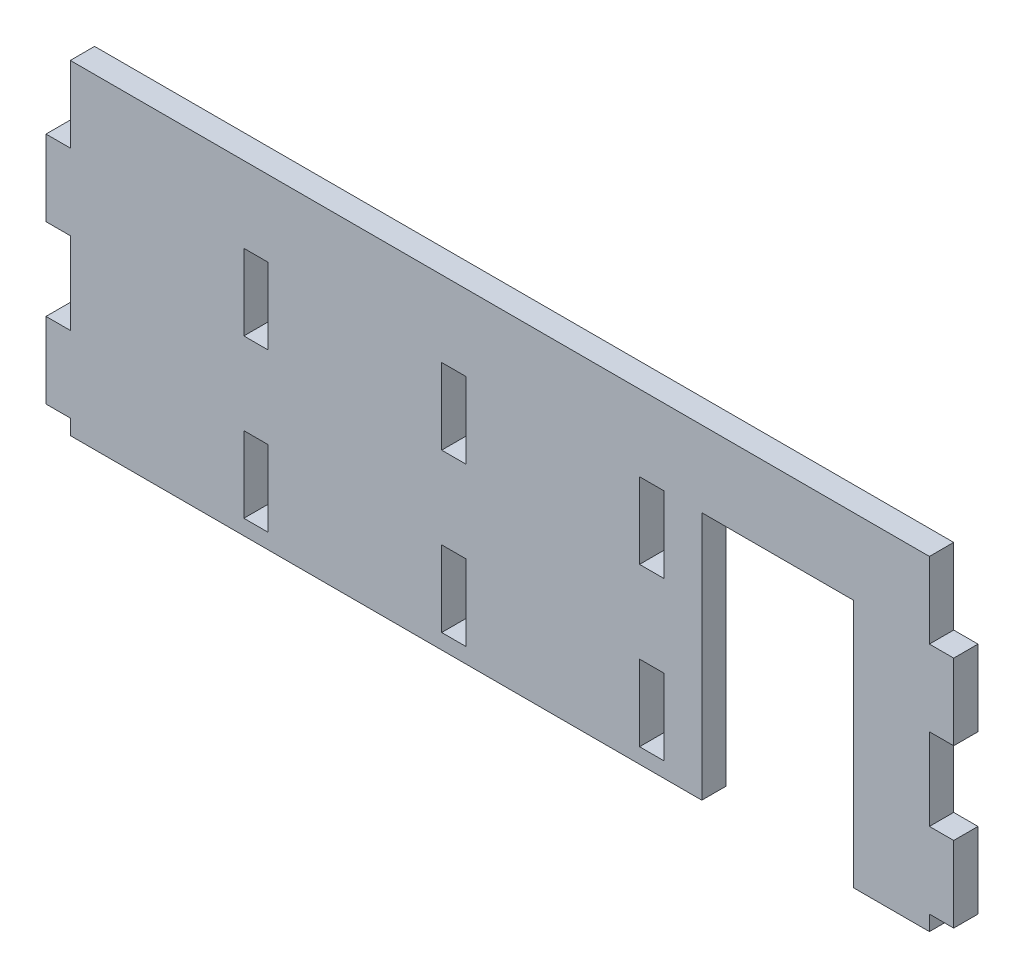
ISO-10303-21;
HEADER;
FILE_DESCRIPTION(('STEP AP214'),'2;1');
FILE_NAME('part.step','',(''),(''),'','','');
FILE_SCHEMA(('AUTOMOTIVE_DESIGN { 1 0 10303 214 1 1 1 1 }'));
ENDSEC;
DATA;
#1=APPLICATION_CONTEXT('core data for automotive mechanical design processes');
#2=APPLICATION_PROTOCOL_DEFINITION('international standard','automotive_design',2000,#1);
#3=PRODUCT_CONTEXT('',#1,'mechanical');
#4=PRODUCT('Part','Part','',(#3));
#5=PRODUCT_RELATED_PRODUCT_CATEGORY('part','',(#4));
#6=PRODUCT_DEFINITION_FORMATION('','',#4);
#7=PRODUCT_DEFINITION_CONTEXT('part definition',#1,'design');
#8=PRODUCT_DEFINITION('design','',#6,#7);
#9=PRODUCT_DEFINITION_SHAPE('','',#8);
#10=(LENGTH_UNIT() NAMED_UNIT(*) SI_UNIT(.MILLI.,.METRE.));
#11=(NAMED_UNIT(*) PLANE_ANGLE_UNIT() SI_UNIT($,.RADIAN.));
#12=(NAMED_UNIT(*) SI_UNIT($,.STERADIAN.) SOLID_ANGLE_UNIT());
#13=UNCERTAINTY_MEASURE_WITH_UNIT(LENGTH_MEASURE(1.E-05),#10,'distance_accuracy_value','');
#14=(GEOMETRIC_REPRESENTATION_CONTEXT(3) GLOBAL_UNCERTAINTY_ASSIGNED_CONTEXT((#13)) GLOBAL_UNIT_ASSIGNED_CONTEXT((#10,
#11,#12)) REPRESENTATION_CONTEXT('',''));
#15=CARTESIAN_POINT('',(0.,0.,0.));
#16=DIRECTION('',(0.,0.,1.));
#17=DIRECTION('',(1.,0.,0.));
#18=AXIS2_PLACEMENT_3D('',#15,#16,#17);
#19=CARTESIAN_POINT('',(415.9,0.,16.));
#20=DIRECTION('',(1.,0.,0.));
#21=DIRECTION('',(0.,0.,-1.));
#22=AXIS2_PLACEMENT_3D('',#19,#20,#21);
#23=PLANE('',#22);
#24=DIRECTION('',(0.,-1.,0.));
#25=VECTOR('',#24,1.);
#26=CARTESIAN_POINT('',(415.9,0.,0.));
#27=LINE('',#26,#25);
#28=CARTESIAN_POINT('',(415.9,204.,0.));
#29=VERTEX_POINT('',#28);
#30=CARTESIAN_POINT('',(415.9,40.,0.));
#31=VERTEX_POINT('',#30);
#32=EDGE_CURVE('E405',#29,#31,#27,.T.);
#33=ORIENTED_EDGE('',*,*,#32,.F.);
#34=DIRECTION('',(0.,0.,-1.));
#35=VECTOR('',#34,1.);
#36=CARTESIAN_POINT('',(415.9,204.,16.));
#37=LINE('',#36,#35);
#38=CARTESIAN_POINT('',(415.9,204.,16.));
#39=VERTEX_POINT('',#38);
#40=EDGE_CURVE('E449',#39,#29,#37,.T.);
#41=ORIENTED_EDGE('',*,*,#40,.F.);
#42=DIRECTION('',(0.,-1.,0.));
#43=VECTOR('',#42,1.);
#44=CARTESIAN_POINT('',(415.9,0.,16.));
#45=LINE('',#44,#43);
#46=CARTESIAN_POINT('',(415.9,40.,16.));
#47=VERTEX_POINT('',#46);
#48=EDGE_CURVE('E525',#39,#47,#45,.T.);
#49=ORIENTED_EDGE('',*,*,#48,.T.);
#50=DIRECTION('',(0.,0.,-1.));
#51=VECTOR('',#50,1.);
#52=CARTESIAN_POINT('',(415.9,40.,16.));
#53=LINE('',#52,#51);
#54=EDGE_CURVE('E444',#47,#31,#53,.T.);
#55=ORIENTED_EDGE('',*,*,#54,.T.);
#56=EDGE_LOOP('',(#33,#41,#49,#55));
#57=FACE_BOUND('',#56,.T.);
#58=ADVANCED_FACE('F179',(#57),#23,.T.);
#59=CARTESIAN_POINT('',(515.9,0.,16.));
#60=DIRECTION('',(1.,0.,0.));
#61=DIRECTION('',(0.,0.,-1.));
#62=AXIS2_PLACEMENT_3D('',#59,#60,#61);
#63=PLANE('',#62);
#64=DIRECTION('',(0.,-1.,0.));
#65=VECTOR('',#64,1.);
#66=CARTESIAN_POINT('',(515.9,0.,0.));
#67=LINE('',#66,#65);
#68=CARTESIAN_POINT('',(515.9,204.,0.));
#69=VERTEX_POINT('',#68);
#70=CARTESIAN_POINT('',(515.9,40.,0.));
#71=VERTEX_POINT('',#70);
#72=EDGE_CURVE('E397',#69,#71,#67,.T.);
#73=ORIENTED_EDGE('',*,*,#72,.T.);
#74=DIRECTION('',(0.,0.,-1.));
#75=VECTOR('',#74,1.);
#76=CARTESIAN_POINT('',(515.9,40.,16.));
#77=LINE('',#76,#75);
#78=CARTESIAN_POINT('',(515.9,40.,16.));
#79=VERTEX_POINT('',#78);
#80=EDGE_CURVE('E455',#79,#71,#77,.T.);
#81=ORIENTED_EDGE('',*,*,#80,.F.);
#82=DIRECTION('',(0.,-1.,0.));
#83=VECTOR('',#82,1.);
#84=CARTESIAN_POINT('',(515.9,0.,16.));
#85=LINE('',#84,#83);
#86=CARTESIAN_POINT('',(515.9,204.,16.));
#87=VERTEX_POINT('',#86);
#88=EDGE_CURVE('E686',#87,#79,#85,.T.);
#89=ORIENTED_EDGE('',*,*,#88,.F.);
#90=DIRECTION('',(0.,0.,-1.));
#91=VECTOR('',#90,1.);
#92=CARTESIAN_POINT('',(515.9,204.,16.));
#93=LINE('',#92,#91);
#94=EDGE_CURVE('E337',#87,#69,#93,.T.);
#95=ORIENTED_EDGE('',*,*,#94,.T.);
#96=EDGE_LOOP('',(#73,#81,#89,#95));
#97=FACE_BOUND('',#96,.T.);
#98=ADVANCED_FACE('F961',(#97),#63,.F.);
#99=CARTESIAN_POINT('',(0.,204.,16.));
#100=DIRECTION('',(0.,1.,0.));
#101=DIRECTION('',(0.,0.,1.));
#102=AXIS2_PLACEMENT_3D('',#99,#100,#101);
#103=PLANE('',#102);
#104=DIRECTION('',(1.,0.,0.));
#105=VECTOR('',#104,1.);
#106=CARTESIAN_POINT('',(0.,204.,0.));
#107=LINE('',#106,#105);
#108=EDGE_CURVE('E402',#29,#69,#107,.T.);
#109=ORIENTED_EDGE('',*,*,#108,.T.);
#110=ORIENTED_EDGE('',*,*,#94,.F.);
#111=DIRECTION('',(1.,0.,0.));
#112=VECTOR('',#111,1.);
#113=CARTESIAN_POINT('',(0.,204.,16.));
#114=LINE('',#113,#112);
#115=EDGE_CURVE('E691',#39,#87,#114,.T.);
#116=ORIENTED_EDGE('',*,*,#115,.F.);
#117=ORIENTED_EDGE('',*,*,#40,.T.);
#118=EDGE_LOOP('',(#109,#110,#116,#117));
#119=FACE_BOUND('',#118,.T.);
#120=ADVANCED_FACE('F669',(#119),#103,.F.);
#121=CARTESIAN_POINT('',(374.9,0.,16.));
#122=DIRECTION('',(1.,0.,0.));
#123=DIRECTION('',(0.,0.,-1.));
#124=AXIS2_PLACEMENT_3D('',#121,#122,#123);
#125=PLANE('',#124);
#126=DIRECTION('',(0.,-1.,0.));
#127=VECTOR('',#126,1.);
#128=CARTESIAN_POINT('',(374.9,0.,0.));
#129=LINE('',#128,#127);
#130=CARTESIAN_POINT('',(374.9,204.,0.));
#131=VERTEX_POINT('',#130);
#132=CARTESIAN_POINT('',(374.9,154.,0.));
#133=VERTEX_POINT('',#132);
#134=EDGE_CURVE('E661',#131,#133,#129,.T.);
#135=ORIENTED_EDGE('',*,*,#134,.F.);
#136=DIRECTION('',(0.,0.,-1.));
#137=VECTOR('',#136,1.);
#138=CARTESIAN_POINT('',(374.9,204.,16.));
#139=LINE('',#138,#137);
#140=CARTESIAN_POINT('',(374.9,204.,16.));
#141=VERTEX_POINT('',#140);
#142=EDGE_CURVE('E460',#141,#131,#139,.T.);
#143=ORIENTED_EDGE('',*,*,#142,.F.);
#144=DIRECTION('',(0.,-1.,0.));
#145=VECTOR('',#144,1.);
#146=CARTESIAN_POINT('',(374.9,0.,16.));
#147=LINE('',#146,#145);
#148=CARTESIAN_POINT('',(374.9,154.,16.));
#149=VERTEX_POINT('',#148);
#150=EDGE_CURVE('E694',#141,#149,#147,.T.);
#151=ORIENTED_EDGE('',*,*,#150,.T.);
#152=DIRECTION('',(0.,0.,-1.));
#153=VECTOR('',#152,1.);
#154=CARTESIAN_POINT('',(374.9,154.,16.));
#155=LINE('',#154,#153);
#156=EDGE_CURVE('E463',#149,#133,#155,.T.);
#157=ORIENTED_EDGE('',*,*,#156,.T.);
#158=EDGE_LOOP('',(#135,#143,#151,#157));
#159=FACE_BOUND('',#158,.T.);
#160=ADVANCED_FACE('F1003',(#159),#125,.T.);
#161=CARTESIAN_POINT('',(2.22044604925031E-13,154.000000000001,16.));
#162=DIRECTION('',(0.,1.,0.));
#163=DIRECTION('',(-1.,0.,0.));
#164=AXIS2_PLACEMENT_3D('',#161,#162,#163);
#165=PLANE('',#164);
#166=DIRECTION('',(1.,0.,0.));
#167=VECTOR('',#166,1.);
#168=CARTESIAN_POINT('',(2.22044604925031E-13,154.000000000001,0.));
#169=LINE('',#168,#167);
#170=CARTESIAN_POINT('',(390.9,154.,0.));
#171=VERTEX_POINT('',#170);
#172=EDGE_CURVE('E658',#133,#171,#169,.T.);
#173=ORIENTED_EDGE('',*,*,#172,.F.);
#174=ORIENTED_EDGE('',*,*,#156,.F.);
#175=DIRECTION('',(1.,0.,0.));
#176=VECTOR('',#175,1.);
#177=CARTESIAN_POINT('',(2.22044604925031E-13,154.000000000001,16.));
#178=LINE('',#177,#176);
#179=CARTESIAN_POINT('',(390.9,154.,16.));
#180=VERTEX_POINT('',#179);
#181=EDGE_CURVE('E699',#149,#180,#178,.T.);
#182=ORIENTED_EDGE('',*,*,#181,.T.);
#183=DIRECTION('',(0.,0.,-1.));
#184=VECTOR('',#183,1.);
#185=CARTESIAN_POINT('',(390.9,154.,16.));
#186=LINE('',#185,#184);
#187=EDGE_CURVE('E467',#180,#171,#186,.T.);
#188=ORIENTED_EDGE('',*,*,#187,.T.);
#189=EDGE_LOOP('',(#173,#174,#182,#188));
#190=FACE_BOUND('',#189,.T.);
#191=ADVANCED_FACE('F1009',(#190),#165,.T.);
#192=CARTESIAN_POINT('',(390.9,0.,16.));
#193=DIRECTION('',(1.,0.,0.));
#194=DIRECTION('',(0.,0.,-1.));
#195=AXIS2_PLACEMENT_3D('',#192,#193,#194);
#196=PLANE('',#195);
#197=DIRECTION('',(0.,-1.,0.));
#198=VECTOR('',#197,1.);
#199=CARTESIAN_POINT('',(390.9,0.,0.));
#200=LINE('',#199,#198);
#201=CARTESIAN_POINT('',(390.9,204.,0.));
#202=VERTEX_POINT('',#201);
#203=EDGE_CURVE('E655',#202,#171,#200,.T.);
#204=ORIENTED_EDGE('',*,*,#203,.T.);
#205=ORIENTED_EDGE('',*,*,#187,.F.);
#206=DIRECTION('',(0.,-1.,0.));
#207=VECTOR('',#206,1.);
#208=CARTESIAN_POINT('',(390.9,0.,16.));
#209=LINE('',#208,#207);
#210=CARTESIAN_POINT('',(390.9,204.,16.));
#211=VERTEX_POINT('',#210);
#212=EDGE_CURVE('E702',#211,#180,#209,.T.);
#213=ORIENTED_EDGE('',*,*,#212,.F.);
#214=DIRECTION('',(0.,0.,-1.));
#215=VECTOR('',#214,1.);
#216=CARTESIAN_POINT('',(390.9,204.,16.));
#217=LINE('',#216,#215);
#218=EDGE_CURVE('E470',#211,#202,#217,.T.);
#219=ORIENTED_EDGE('',*,*,#218,.T.);
#220=EDGE_LOOP('',(#204,#205,#213,#219));
#221=FACE_BOUND('',#220,.T.);
#222=ADVANCED_FACE('F1012',(#221),#196,.F.);
#223=CARTESIAN_POINT('',(0.,204.,16.));
#224=DIRECTION('',(0.,1.,0.));
#225=DIRECTION('',(0.,0.,1.));
#226=AXIS2_PLACEMENT_3D('',#223,#224,#225);
#227=PLANE('',#226);
#228=DIRECTION('',(1.,0.,0.));
#229=VECTOR('',#228,1.);
#230=CARTESIAN_POINT('',(0.,204.,0.));
#231=LINE('',#230,#229);
#232=EDGE_CURVE('E652',#131,#202,#231,.T.);
#233=ORIENTED_EDGE('',*,*,#232,.T.);
#234=ORIENTED_EDGE('',*,*,#218,.F.);
#235=DIRECTION('',(1.,0.,0.));
#236=VECTOR('',#235,1.);
#237=CARTESIAN_POINT('',(0.,204.,16.));
#238=LINE('',#237,#236);
#239=EDGE_CURVE('E705',#141,#211,#238,.T.);
#240=ORIENTED_EDGE('',*,*,#239,.F.);
#241=ORIENTED_EDGE('',*,*,#142,.T.);
#242=EDGE_LOOP('',(#233,#234,#240,#241));
#243=FACE_BOUND('',#242,.T.);
#244=ADVANCED_FACE('F1013',(#243),#227,.F.);
#245=CARTESIAN_POINT('',(244.6,0.,16.));
#246=DIRECTION('',(1.,0.,0.));
#247=DIRECTION('',(0.,0.,-1.));
#248=AXIS2_PLACEMENT_3D('',#245,#246,#247);
#249=PLANE('',#248);
#250=DIRECTION('',(0.,-1.,0.));
#251=VECTOR('',#250,1.);
#252=CARTESIAN_POINT('',(244.6,0.,0.));
#253=LINE('',#252,#251);
#254=CARTESIAN_POINT('',(244.6,204.,0.));
#255=VERTEX_POINT('',#254);
#256=CARTESIAN_POINT('',(244.6,154.,0.));
#257=VERTEX_POINT('',#256);
#258=EDGE_CURVE('E649',#255,#257,#253,.T.);
#259=ORIENTED_EDGE('',*,*,#258,.F.);
#260=DIRECTION('',(0.,0.,-1.));
#261=VECTOR('',#260,1.);
#262=CARTESIAN_POINT('',(244.6,204.,16.));
#263=LINE('',#262,#261);
#264=CARTESIAN_POINT('',(244.6,204.,16.));
#265=VERTEX_POINT('',#264);
#266=EDGE_CURVE('E473',#265,#255,#263,.T.);
#267=ORIENTED_EDGE('',*,*,#266,.F.);
#268=DIRECTION('',(0.,-1.,0.));
#269=VECTOR('',#268,1.);
#270=CARTESIAN_POINT('',(244.6,0.,16.));
#271=LINE('',#270,#269);
#272=CARTESIAN_POINT('',(244.6,154.,16.));
#273=VERTEX_POINT('',#272);
#274=EDGE_CURVE('E708',#265,#273,#271,.T.);
#275=ORIENTED_EDGE('',*,*,#274,.T.);
#276=DIRECTION('',(0.,0.,-1.));
#277=VECTOR('',#276,1.);
#278=CARTESIAN_POINT('',(244.6,154.,16.));
#279=LINE('',#278,#277);
#280=EDGE_CURVE('E476',#273,#257,#279,.T.);
#281=ORIENTED_EDGE('',*,*,#280,.T.);
#282=EDGE_LOOP('',(#259,#267,#275,#281));
#283=FACE_BOUND('',#282,.T.);
#284=ADVANCED_FACE('F1016',(#283),#249,.T.);
#285=CARTESIAN_POINT('',(2.22044604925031E-13,154.,16.));
#286=DIRECTION('',(0.,1.,0.));
#287=DIRECTION('',(-1.,0.,0.));
#288=AXIS2_PLACEMENT_3D('',#285,#286,#287);
#289=PLANE('',#288);
#290=DIRECTION('',(1.,0.,0.));
#291=VECTOR('',#290,1.);
#292=CARTESIAN_POINT('',(2.22044604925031E-13,154.,0.));
#293=LINE('',#292,#291);
#294=CARTESIAN_POINT('',(260.6,154.,0.));
#295=VERTEX_POINT('',#294);
#296=EDGE_CURVE('E646',#257,#295,#293,.T.);
#297=ORIENTED_EDGE('',*,*,#296,.F.);
#298=ORIENTED_EDGE('',*,*,#280,.F.);
#299=DIRECTION('',(1.,0.,0.));
#300=VECTOR('',#299,1.);
#301=CARTESIAN_POINT('',(2.22044604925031E-13,154.,16.));
#302=LINE('',#301,#300);
#303=CARTESIAN_POINT('',(260.6,154.,16.));
#304=VERTEX_POINT('',#303);
#305=EDGE_CURVE('E711',#273,#304,#302,.T.);
#306=ORIENTED_EDGE('',*,*,#305,.T.);
#307=DIRECTION('',(0.,0.,-1.));
#308=VECTOR('',#307,1.);
#309=CARTESIAN_POINT('',(260.6,154.,16.));
#310=LINE('',#309,#308);
#311=EDGE_CURVE('E480',#304,#295,#310,.T.);
#312=ORIENTED_EDGE('',*,*,#311,.T.);
#313=EDGE_LOOP('',(#297,#298,#306,#312));
#314=FACE_BOUND('',#313,.T.);
#315=ADVANCED_FACE('F1022',(#314),#289,.T.);
#316=CARTESIAN_POINT('',(260.6,0.,16.));
#317=DIRECTION('',(1.,0.,0.));
#318=DIRECTION('',(0.,0.,-1.));
#319=AXIS2_PLACEMENT_3D('',#316,#317,#318);
#320=PLANE('',#319);
#321=DIRECTION('',(0.,-1.,0.));
#322=VECTOR('',#321,1.);
#323=CARTESIAN_POINT('',(260.6,0.,0.));
#324=LINE('',#323,#322);
#325=CARTESIAN_POINT('',(260.6,204.,0.));
#326=VERTEX_POINT('',#325);
#327=EDGE_CURVE('E643',#326,#295,#324,.T.);
#328=ORIENTED_EDGE('',*,*,#327,.T.);
#329=ORIENTED_EDGE('',*,*,#311,.F.);
#330=DIRECTION('',(0.,-1.,0.));
#331=VECTOR('',#330,1.);
#332=CARTESIAN_POINT('',(260.6,0.,16.));
#333=LINE('',#332,#331);
#334=CARTESIAN_POINT('',(260.6,204.,16.));
#335=VERTEX_POINT('',#334);
#336=EDGE_CURVE('E714',#335,#304,#333,.T.);
#337=ORIENTED_EDGE('',*,*,#336,.F.);
#338=DIRECTION('',(0.,0.,-1.));
#339=VECTOR('',#338,1.);
#340=CARTESIAN_POINT('',(260.6,204.,16.));
#341=LINE('',#340,#339);
#342=EDGE_CURVE('E464',#335,#326,#341,.T.);
#343=ORIENTED_EDGE('',*,*,#342,.T.);
#344=EDGE_LOOP('',(#328,#329,#337,#343));
#345=FACE_BOUND('',#344,.T.);
#346=ADVANCED_FACE('F1030',(#345),#320,.F.);
#347=CARTESIAN_POINT('',(0.,204.,16.));
#348=DIRECTION('',(0.,1.,0.));
#349=DIRECTION('',(0.,0.,1.));
#350=AXIS2_PLACEMENT_3D('',#347,#348,#349);
#351=PLANE('',#350);
#352=DIRECTION('',(1.,0.,0.));
#353=VECTOR('',#352,1.);
#354=CARTESIAN_POINT('',(0.,204.,0.));
#355=LINE('',#354,#353);
#356=EDGE_CURVE('E640',#255,#326,#355,.T.);
#357=ORIENTED_EDGE('',*,*,#356,.T.);
#358=ORIENTED_EDGE('',*,*,#342,.F.);
#359=DIRECTION('',(1.,0.,0.));
#360=VECTOR('',#359,1.);
#361=CARTESIAN_POINT('',(0.,204.,16.));
#362=LINE('',#361,#360);
#363=EDGE_CURVE('E717',#265,#335,#362,.T.);
#364=ORIENTED_EDGE('',*,*,#363,.F.);
#365=ORIENTED_EDGE('',*,*,#266,.T.);
#366=EDGE_LOOP('',(#357,#358,#364,#365));
#367=FACE_BOUND('',#366,.T.);
#368=ADVANCED_FACE('F1034',(#367),#351,.F.);
#369=CARTESIAN_POINT('',(114.3,0.,16.));
#370=DIRECTION('',(1.,0.,0.));
#371=DIRECTION('',(0.,1.,0.));
#372=AXIS2_PLACEMENT_3D('',#369,#370,#371);
#373=PLANE('',#372);
#374=DIRECTION('',(0.,-1.,0.));
#375=VECTOR('',#374,1.);
#376=CARTESIAN_POINT('',(114.3,0.,0.));
#377=LINE('',#376,#375);
#378=CARTESIAN_POINT('',(114.3,204.,0.));
#379=VERTEX_POINT('',#378);
#380=CARTESIAN_POINT('',(114.3,154.,0.));
#381=VERTEX_POINT('',#380);
#382=EDGE_CURVE('E637',#379,#381,#377,.T.);
#383=ORIENTED_EDGE('',*,*,#382,.F.);
#384=DIRECTION('',(0.,0.,-1.));
#385=VECTOR('',#384,1.);
#386=CARTESIAN_POINT('',(114.3,204.,16.));
#387=LINE('',#386,#385);
#388=CARTESIAN_POINT('',(114.3,204.,16.));
#389=VERTEX_POINT('',#388);
#390=EDGE_CURVE('E485',#389,#379,#387,.T.);
#391=ORIENTED_EDGE('',*,*,#390,.F.);
#392=DIRECTION('',(0.,-1.,0.));
#393=VECTOR('',#392,1.);
#394=CARTESIAN_POINT('',(114.3,0.,16.));
#395=LINE('',#394,#393);
#396=CARTESIAN_POINT('',(114.3,154.,16.));
#397=VERTEX_POINT('',#396);
#398=EDGE_CURVE('E720',#389,#397,#395,.T.);
#399=ORIENTED_EDGE('',*,*,#398,.T.);
#400=DIRECTION('',(0.,0.,-1.));
#401=VECTOR('',#400,1.);
#402=CARTESIAN_POINT('',(114.3,154.,16.));
#403=LINE('',#402,#401);
#404=EDGE_CURVE('E488',#397,#381,#403,.T.);
#405=ORIENTED_EDGE('',*,*,#404,.T.);
#406=EDGE_LOOP('',(#383,#391,#399,#405));
#407=FACE_BOUND('',#406,.T.);
#408=ADVANCED_FACE('F1038',(#407),#373,.T.);
#409=CARTESIAN_POINT('',(0.,154.,16.));
#410=DIRECTION('',(0.,1.,0.));
#411=DIRECTION('',(0.,0.,1.));
#412=AXIS2_PLACEMENT_3D('',#409,#410,#411);
#413=PLANE('',#412);
#414=DIRECTION('',(1.,0.,0.));
#415=VECTOR('',#414,1.);
#416=CARTESIAN_POINT('',(0.,154.,0.));
#417=LINE('',#416,#415);
#418=CARTESIAN_POINT('',(130.3,154.,0.));
#419=VERTEX_POINT('',#418);
#420=EDGE_CURVE('E634',#381,#419,#417,.T.);
#421=ORIENTED_EDGE('',*,*,#420,.F.);
#422=ORIENTED_EDGE('',*,*,#404,.F.);
#423=DIRECTION('',(1.,0.,0.));
#424=VECTOR('',#423,1.);
#425=CARTESIAN_POINT('',(0.,154.,16.));
#426=LINE('',#425,#424);
#427=CARTESIAN_POINT('',(130.3,154.,16.));
#428=VERTEX_POINT('',#427);
#429=EDGE_CURVE('E723',#397,#428,#426,.T.);
#430=ORIENTED_EDGE('',*,*,#429,.T.);
#431=DIRECTION('',(0.,0.,-1.));
#432=VECTOR('',#431,1.);
#433=CARTESIAN_POINT('',(130.3,154.,16.));
#434=LINE('',#433,#432);
#435=EDGE_CURVE('E492',#428,#419,#434,.T.);
#436=ORIENTED_EDGE('',*,*,#435,.T.);
#437=EDGE_LOOP('',(#421,#422,#430,#436));
#438=FACE_BOUND('',#437,.T.);
#439=ADVANCED_FACE('F1042',(#438),#413,.T.);
#440=CARTESIAN_POINT('',(130.3,0.,16.));
#441=DIRECTION('',(1.,0.,0.));
#442=DIRECTION('',(0.,0.,-1.));
#443=AXIS2_PLACEMENT_3D('',#440,#441,#442);
#444=PLANE('',#443);
#445=DIRECTION('',(0.,-1.,0.));
#446=VECTOR('',#445,1.);
#447=CARTESIAN_POINT('',(130.3,0.,0.));
#448=LINE('',#447,#446);
#449=CARTESIAN_POINT('',(130.3,204.,0.));
#450=VERTEX_POINT('',#449);
#451=EDGE_CURVE('E631',#450,#419,#448,.T.);
#452=ORIENTED_EDGE('',*,*,#451,.T.);
#453=ORIENTED_EDGE('',*,*,#435,.F.);
#454=DIRECTION('',(0.,-1.,0.));
#455=VECTOR('',#454,1.);
#456=CARTESIAN_POINT('',(130.3,0.,16.));
#457=LINE('',#456,#455);
#458=CARTESIAN_POINT('',(130.3,204.,16.));
#459=VERTEX_POINT('',#458);
#460=EDGE_CURVE('E726',#459,#428,#457,.T.);
#461=ORIENTED_EDGE('',*,*,#460,.F.);
#462=DIRECTION('',(0.,0.,-1.));
#463=VECTOR('',#462,1.);
#464=CARTESIAN_POINT('',(130.3,204.,16.));
#465=LINE('',#464,#463);
#466=EDGE_CURVE('E477',#459,#450,#465,.T.);
#467=ORIENTED_EDGE('',*,*,#466,.T.);
#468=EDGE_LOOP('',(#452,#453,#461,#467));
#469=FACE_BOUND('',#468,.T.);
#470=ADVANCED_FACE('F1046',(#469),#444,.F.);
#471=CARTESIAN_POINT('',(0.,204.,16.));
#472=DIRECTION('',(0.,1.,0.));
#473=DIRECTION('',(0.,0.,1.));
#474=AXIS2_PLACEMENT_3D('',#471,#472,#473);
#475=PLANE('',#474);
#476=DIRECTION('',(1.,0.,0.));
#477=VECTOR('',#476,1.);
#478=CARTESIAN_POINT('',(0.,204.,0.));
#479=LINE('',#478,#477);
#480=EDGE_CURVE('E628',#379,#450,#479,.T.);
#481=ORIENTED_EDGE('',*,*,#480,.T.);
#482=ORIENTED_EDGE('',*,*,#466,.F.);
#483=DIRECTION('',(1.,0.,0.));
#484=VECTOR('',#483,1.);
#485=CARTESIAN_POINT('',(0.,204.,16.));
#486=LINE('',#485,#484);
#487=EDGE_CURVE('E729',#389,#459,#486,.T.);
#488=ORIENTED_EDGE('',*,*,#487,.F.);
#489=ORIENTED_EDGE('',*,*,#390,.T.);
#490=EDGE_LOOP('',(#481,#482,#488,#489));
#491=FACE_BOUND('',#490,.T.);
#492=ADVANCED_FACE('F1050',(#491),#475,.F.);
#493=CARTESIAN_POINT('',(390.9,0.,16.));
#494=DIRECTION('',(-1.,0.,0.));
#495=DIRECTION('',(0.,0.,1.));
#496=AXIS2_PLACEMENT_3D('',#493,#494,#495);
#497=PLANE('',#496);
#498=DIRECTION('',(0.,1.,0.));
#499=VECTOR('',#498,1.);
#500=CARTESIAN_POINT('',(390.9,0.,0.));
#501=LINE('',#500,#499);
#502=CARTESIAN_POINT('',(390.9,50.,0.));
#503=VERTEX_POINT('',#502);
#504=CARTESIAN_POINT('',(390.9,100.,0.));
#505=VERTEX_POINT('',#504);
#506=EDGE_CURVE('E625',#503,#505,#501,.T.);
#507=ORIENTED_EDGE('',*,*,#506,.F.);
#508=DIRECTION('',(0.,0.,-1.));
#509=VECTOR('',#508,1.);
#510=CARTESIAN_POINT('',(390.9,50.,16.));
#511=LINE('',#510,#509);
#512=CARTESIAN_POINT('',(390.9,50.,16.));
#513=VERTEX_POINT('',#512);
#514=EDGE_CURVE('E497',#513,#503,#511,.T.);
#515=ORIENTED_EDGE('',*,*,#514,.F.);
#516=DIRECTION('',(0.,1.,0.));
#517=VECTOR('',#516,1.);
#518=CARTESIAN_POINT('',(390.9,0.,16.));
#519=LINE('',#518,#517);
#520=CARTESIAN_POINT('',(390.9,100.,16.));
#521=VERTEX_POINT('',#520);
#522=EDGE_CURVE('E732',#513,#521,#519,.T.);
#523=ORIENTED_EDGE('',*,*,#522,.T.);
#524=DIRECTION('',(0.,0.,-1.));
#525=VECTOR('',#524,1.);
#526=CARTESIAN_POINT('',(390.9,100.,16.));
#527=LINE('',#526,#525);
#528=EDGE_CURVE('E500',#521,#505,#527,.T.);
#529=ORIENTED_EDGE('',*,*,#528,.T.);
#530=EDGE_LOOP('',(#507,#515,#523,#529));
#531=FACE_BOUND('',#530,.T.);
#532=ADVANCED_FACE('F1054',(#531),#497,.T.);
#533=CARTESIAN_POINT('',(-2.22044604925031E-13,99.9999999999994,16.));
#534=DIRECTION('',(0.,1.,0.));
#535=DIRECTION('',(-1.,0.,0.));
#536=AXIS2_PLACEMENT_3D('',#533,#534,#535);
#537=PLANE('',#536);
#538=DIRECTION('',(1.,0.,0.));
#539=VECTOR('',#538,1.);
#540=CARTESIAN_POINT('',(-2.22044604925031E-13,99.9999999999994,0.));
#541=LINE('',#540,#539);
#542=CARTESIAN_POINT('',(374.9,100.,0.));
#543=VERTEX_POINT('',#542);
#544=EDGE_CURVE('E622',#543,#505,#541,.T.);
#545=ORIENTED_EDGE('',*,*,#544,.T.);
#546=ORIENTED_EDGE('',*,*,#528,.F.);
#547=DIRECTION('',(1.,0.,0.));
#548=VECTOR('',#547,1.);
#549=CARTESIAN_POINT('',(-2.22044604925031E-13,99.9999999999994,16.));
#550=LINE('',#549,#548);
#551=CARTESIAN_POINT('',(374.9,100.,16.));
#552=VERTEX_POINT('',#551);
#553=EDGE_CURVE('E735',#552,#521,#550,.T.);
#554=ORIENTED_EDGE('',*,*,#553,.F.);
#555=DIRECTION('',(0.,0.,-1.));
#556=VECTOR('',#555,1.);
#557=CARTESIAN_POINT('',(374.9,100.,16.));
#558=LINE('',#557,#556);
#559=EDGE_CURVE('E504',#552,#543,#558,.T.);
#560=ORIENTED_EDGE('',*,*,#559,.T.);
#561=EDGE_LOOP('',(#545,#546,#554,#560));
#562=FACE_BOUND('',#561,.T.);
#563=ADVANCED_FACE('F1058',(#562),#537,.F.);
#564=CARTESIAN_POINT('',(374.9,0.,16.));
#565=DIRECTION('',(-1.,0.,0.));
#566=DIRECTION('',(0.,0.,1.));
#567=AXIS2_PLACEMENT_3D('',#564,#565,#566);
#568=PLANE('',#567);
#569=DIRECTION('',(0.,1.,0.));
#570=VECTOR('',#569,1.);
#571=CARTESIAN_POINT('',(374.9,0.,0.));
#572=LINE('',#571,#570);
#573=CARTESIAN_POINT('',(374.9,50.,0.));
#574=VERTEX_POINT('',#573);
#575=EDGE_CURVE('E619',#574,#543,#572,.T.);
#576=ORIENTED_EDGE('',*,*,#575,.T.);
#577=ORIENTED_EDGE('',*,*,#559,.F.);
#578=DIRECTION('',(0.,1.,0.));
#579=VECTOR('',#578,1.);
#580=CARTESIAN_POINT('',(374.9,0.,16.));
#581=LINE('',#580,#579);
#582=CARTESIAN_POINT('',(374.9,50.,16.));
#583=VERTEX_POINT('',#582);
#584=EDGE_CURVE('E738',#583,#552,#581,.T.);
#585=ORIENTED_EDGE('',*,*,#584,.F.);
#586=DIRECTION('',(0.,0.,-1.));
#587=VECTOR('',#586,1.);
#588=CARTESIAN_POINT('',(374.9,50.,16.));
#589=LINE('',#588,#587);
#590=EDGE_CURVE('E489',#583,#574,#589,.T.);
#591=ORIENTED_EDGE('',*,*,#590,.T.);
#592=EDGE_LOOP('',(#576,#577,#585,#591));
#593=FACE_BOUND('',#592,.T.);
#594=ADVANCED_FACE('F1062',(#593),#568,.F.);
#595=CARTESIAN_POINT('',(0.,50.,16.));
#596=DIRECTION('',(0.,1.,0.));
#597=DIRECTION('',(0.,0.,1.));
#598=AXIS2_PLACEMENT_3D('',#595,#596,#597);
#599=PLANE('',#598);
#600=DIRECTION('',(1.,0.,0.));
#601=VECTOR('',#600,1.);
#602=CARTESIAN_POINT('',(0.,50.,0.));
#603=LINE('',#602,#601);
#604=EDGE_CURVE('E616',#574,#503,#603,.T.);
#605=ORIENTED_EDGE('',*,*,#604,.F.);
#606=ORIENTED_EDGE('',*,*,#590,.F.);
#607=DIRECTION('',(1.,0.,0.));
#608=VECTOR('',#607,1.);
#609=CARTESIAN_POINT('',(0.,50.,16.));
#610=LINE('',#609,#608);
#611=EDGE_CURVE('E741',#583,#513,#610,.T.);
#612=ORIENTED_EDGE('',*,*,#611,.T.);
#613=ORIENTED_EDGE('',*,*,#514,.T.);
#614=EDGE_LOOP('',(#605,#606,#612,#613));
#615=FACE_BOUND('',#614,.T.);
#616=ADVANCED_FACE('F1066',(#615),#599,.T.);
#617=CARTESIAN_POINT('',(130.3,0.,16.));
#618=DIRECTION('',(-1.,0.,0.));
#619=DIRECTION('',(0.,0.,1.));
#620=AXIS2_PLACEMENT_3D('',#617,#618,#619);
#621=PLANE('',#620);
#622=DIRECTION('',(0.,1.,0.));
#623=VECTOR('',#622,1.);
#624=CARTESIAN_POINT('',(130.3,0.,0.));
#625=LINE('',#624,#623);
#626=CARTESIAN_POINT('',(130.3,50.,0.));
#627=VERTEX_POINT('',#626);
#628=CARTESIAN_POINT('',(130.3,100.,0.));
#629=VERTEX_POINT('',#628);
#630=EDGE_CURVE('E613',#627,#629,#625,.T.);
#631=ORIENTED_EDGE('',*,*,#630,.F.);
#632=DIRECTION('',(0.,0.,-1.));
#633=VECTOR('',#632,1.);
#634=CARTESIAN_POINT('',(130.3,50.,16.));
#635=LINE('',#634,#633);
#636=CARTESIAN_POINT('',(130.3,50.,16.));
#637=VERTEX_POINT('',#636);
#638=EDGE_CURVE('E509',#637,#627,#635,.T.);
#639=ORIENTED_EDGE('',*,*,#638,.F.);
#640=DIRECTION('',(0.,1.,0.));
#641=VECTOR('',#640,1.);
#642=CARTESIAN_POINT('',(130.3,0.,16.));
#643=LINE('',#642,#641);
#644=CARTESIAN_POINT('',(130.3,100.,16.));
#645=VERTEX_POINT('',#644);
#646=EDGE_CURVE('E744',#637,#645,#643,.T.);
#647=ORIENTED_EDGE('',*,*,#646,.T.);
#648=DIRECTION('',(0.,0.,-1.));
#649=VECTOR('',#648,1.);
#650=CARTESIAN_POINT('',(130.3,100.,16.));
#651=LINE('',#650,#649);
#652=EDGE_CURVE('E512',#645,#629,#651,.T.);
#653=ORIENTED_EDGE('',*,*,#652,.T.);
#654=EDGE_LOOP('',(#631,#639,#647,#653));
#655=FACE_BOUND('',#654,.T.);
#656=ADVANCED_FACE('F1070',(#655),#621,.T.);
#657=CARTESIAN_POINT('',(0.,100.,16.));
#658=DIRECTION('',(0.,1.,0.));
#659=DIRECTION('',(0.,0.,1.));
#660=AXIS2_PLACEMENT_3D('',#657,#658,#659);
#661=PLANE('',#660);
#662=DIRECTION('',(1.,0.,0.));
#663=VECTOR('',#662,1.);
#664=CARTESIAN_POINT('',(0.,100.,0.));
#665=LINE('',#664,#663);
#666=CARTESIAN_POINT('',(114.3,100.,0.));
#667=VERTEX_POINT('',#666);
#668=EDGE_CURVE('E610',#667,#629,#665,.T.);
#669=ORIENTED_EDGE('',*,*,#668,.T.);
#670=ORIENTED_EDGE('',*,*,#652,.F.);
#671=DIRECTION('',(1.,0.,0.));
#672=VECTOR('',#671,1.);
#673=CARTESIAN_POINT('',(0.,100.,16.));
#674=LINE('',#673,#672);
#675=CARTESIAN_POINT('',(114.3,100.,16.));
#676=VERTEX_POINT('',#675);
#677=EDGE_CURVE('E747',#676,#645,#674,.T.);
#678=ORIENTED_EDGE('',*,*,#677,.F.);
#679=DIRECTION('',(0.,0.,-1.));
#680=VECTOR('',#679,1.);
#681=CARTESIAN_POINT('',(114.3,100.,16.));
#682=LINE('',#681,#680);
#683=EDGE_CURVE('E516',#676,#667,#682,.T.);
#684=ORIENTED_EDGE('',*,*,#683,.T.);
#685=EDGE_LOOP('',(#669,#670,#678,#684));
#686=FACE_BOUND('',#685,.T.);
#687=ADVANCED_FACE('F1074',(#686),#661,.F.);
#688=CARTESIAN_POINT('',(114.3,0.,16.));
#689=DIRECTION('',(-1.,0.,0.));
#690=DIRECTION('',(0.,-1.,0.));
#691=AXIS2_PLACEMENT_3D('',#688,#689,#690);
#692=PLANE('',#691);
#693=DIRECTION('',(0.,1.,0.));
#694=VECTOR('',#693,1.);
#695=CARTESIAN_POINT('',(114.3,0.,0.));
#696=LINE('',#695,#694);
#697=CARTESIAN_POINT('',(114.3,50.,0.));
#698=VERTEX_POINT('',#697);
#699=EDGE_CURVE('E607',#698,#667,#696,.T.);
#700=ORIENTED_EDGE('',*,*,#699,.T.);
#701=ORIENTED_EDGE('',*,*,#683,.F.);
#702=DIRECTION('',(0.,1.,0.));
#703=VECTOR('',#702,1.);
#704=CARTESIAN_POINT('',(114.3,0.,16.));
#705=LINE('',#704,#703);
#706=CARTESIAN_POINT('',(114.3,50.,16.));
#707=VERTEX_POINT('',#706);
#708=EDGE_CURVE('E750',#707,#676,#705,.T.);
#709=ORIENTED_EDGE('',*,*,#708,.F.);
#710=DIRECTION('',(0.,0.,-1.));
#711=VECTOR('',#710,1.);
#712=CARTESIAN_POINT('',(114.3,50.,16.));
#713=LINE('',#712,#711);
#714=EDGE_CURVE('E501',#707,#698,#713,.T.);
#715=ORIENTED_EDGE('',*,*,#714,.T.);
#716=EDGE_LOOP('',(#700,#701,#709,#715));
#717=FACE_BOUND('',#716,.T.);
#718=ADVANCED_FACE('F1078',(#717),#692,.F.);
#719=CARTESIAN_POINT('',(0.,50.,16.));
#720=DIRECTION('',(0.,1.,0.));
#721=DIRECTION('',(0.,0.,1.));
#722=AXIS2_PLACEMENT_3D('',#719,#720,#721);
#723=PLANE('',#722);
#724=DIRECTION('',(1.,0.,0.));
#725=VECTOR('',#724,1.);
#726=CARTESIAN_POINT('',(0.,50.,0.));
#727=LINE('',#726,#725);
#728=EDGE_CURVE('E604',#698,#627,#727,.T.);
#729=ORIENTED_EDGE('',*,*,#728,.F.);
#730=ORIENTED_EDGE('',*,*,#714,.F.);
#731=DIRECTION('',(1.,0.,0.));
#732=VECTOR('',#731,1.);
#733=CARTESIAN_POINT('',(0.,50.,16.));
#734=LINE('',#733,#732);
#735=EDGE_CURVE('E753',#707,#637,#734,.T.);
#736=ORIENTED_EDGE('',*,*,#735,.T.);
#737=ORIENTED_EDGE('',*,*,#638,.T.);
#738=EDGE_LOOP('',(#729,#730,#736,#737));
#739=FACE_BOUND('',#738,.T.);
#740=ADVANCED_FACE('F1082',(#739),#723,.T.);
#741=CARTESIAN_POINT('',(260.6,0.,16.));
#742=DIRECTION('',(-1.,0.,0.));
#743=DIRECTION('',(0.,0.,1.));
#744=AXIS2_PLACEMENT_3D('',#741,#742,#743);
#745=PLANE('',#744);
#746=DIRECTION('',(0.,1.,0.));
#747=VECTOR('',#746,1.);
#748=CARTESIAN_POINT('',(260.6,0.,0.));
#749=LINE('',#748,#747);
#750=CARTESIAN_POINT('',(260.6,50.,0.));
#751=VERTEX_POINT('',#750);
#752=CARTESIAN_POINT('',(260.6,100.,0.));
#753=VERTEX_POINT('',#752);
#754=EDGE_CURVE('E601',#751,#753,#749,.T.);
#755=ORIENTED_EDGE('',*,*,#754,.F.);
#756=DIRECTION('',(0.,0.,-1.));
#757=VECTOR('',#756,1.);
#758=CARTESIAN_POINT('',(260.6,50.,16.));
#759=LINE('',#758,#757);
#760=CARTESIAN_POINT('',(260.6,50.,16.));
#761=VERTEX_POINT('',#760);
#762=EDGE_CURVE('E521',#761,#751,#759,.T.);
#763=ORIENTED_EDGE('',*,*,#762,.F.);
#764=DIRECTION('',(0.,1.,0.));
#765=VECTOR('',#764,1.);
#766=CARTESIAN_POINT('',(260.6,0.,16.));
#767=LINE('',#766,#765);
#768=CARTESIAN_POINT('',(260.6,100.,16.));
#769=VERTEX_POINT('',#768);
#770=EDGE_CURVE('E756',#761,#769,#767,.T.);
#771=ORIENTED_EDGE('',*,*,#770,.T.);
#772=DIRECTION('',(0.,0.,-1.));
#773=VECTOR('',#772,1.);
#774=CARTESIAN_POINT('',(260.6,100.,16.));
#775=LINE('',#774,#773);
#776=EDGE_CURVE('E524',#769,#753,#775,.T.);
#777=ORIENTED_EDGE('',*,*,#776,.T.);
#778=EDGE_LOOP('',(#755,#763,#771,#777));
#779=FACE_BOUND('',#778,.T.);
#780=ADVANCED_FACE('F785',(#779),#745,.T.);
#781=CARTESIAN_POINT('',(-2.22044604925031E-13,99.9999999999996,16.));
#782=DIRECTION('',(0.,1.,0.));
#783=DIRECTION('',(-1.,0.,0.));
#784=AXIS2_PLACEMENT_3D('',#781,#782,#783);
#785=PLANE('',#784);
#786=DIRECTION('',(1.,0.,0.));
#787=VECTOR('',#786,1.);
#788=CARTESIAN_POINT('',(-2.22044604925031E-13,99.9999999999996,0.));
#789=LINE('',#788,#787);
#790=CARTESIAN_POINT('',(244.6,100.,0.));
#791=VERTEX_POINT('',#790);
#792=EDGE_CURVE('E598',#791,#753,#789,.T.);
#793=ORIENTED_EDGE('',*,*,#792,.T.);
#794=ORIENTED_EDGE('',*,*,#776,.F.);
#795=DIRECTION('',(1.,0.,0.));
#796=VECTOR('',#795,1.);
#797=CARTESIAN_POINT('',(-2.22044604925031E-13,99.9999999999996,16.));
#798=LINE('',#797,#796);
#799=CARTESIAN_POINT('',(244.6,100.,16.));
#800=VERTEX_POINT('',#799);
#801=EDGE_CURVE('E759',#800,#769,#798,.T.);
#802=ORIENTED_EDGE('',*,*,#801,.F.);
#803=DIRECTION('',(0.,0.,-1.));
#804=VECTOR('',#803,1.);
#805=CARTESIAN_POINT('',(244.6,100.,16.));
#806=LINE('',#805,#804);
#807=EDGE_CURVE('E528',#800,#791,#806,.T.);
#808=ORIENTED_EDGE('',*,*,#807,.T.);
#809=EDGE_LOOP('',(#793,#794,#802,#808));
#810=FACE_BOUND('',#809,.T.);
#811=ADVANCED_FACE('F1089',(#810),#785,.F.);
#812=CARTESIAN_POINT('',(244.6,0.,16.));
#813=DIRECTION('',(-1.,0.,0.));
#814=DIRECTION('',(0.,0.,1.));
#815=AXIS2_PLACEMENT_3D('',#812,#813,#814);
#816=PLANE('',#815);
#817=DIRECTION('',(0.,1.,0.));
#818=VECTOR('',#817,1.);
#819=CARTESIAN_POINT('',(244.6,0.,0.));
#820=LINE('',#819,#818);
#821=CARTESIAN_POINT('',(244.6,50.,0.));
#822=VERTEX_POINT('',#821);
#823=EDGE_CURVE('E595',#822,#791,#820,.T.);
#824=ORIENTED_EDGE('',*,*,#823,.T.);
#825=ORIENTED_EDGE('',*,*,#807,.F.);
#826=DIRECTION('',(0.,1.,0.));
#827=VECTOR('',#826,1.);
#828=CARTESIAN_POINT('',(244.6,0.,16.));
#829=LINE('',#828,#827);
#830=CARTESIAN_POINT('',(244.6,50.,16.));
#831=VERTEX_POINT('',#830);
#832=EDGE_CURVE('E762',#831,#800,#829,.T.);
#833=ORIENTED_EDGE('',*,*,#832,.F.);
#834=DIRECTION('',(0.,0.,-1.));
#835=VECTOR('',#834,1.);
#836=CARTESIAN_POINT('',(244.6,50.,16.));
#837=LINE('',#836,#835);
#838=EDGE_CURVE('E513',#831,#822,#837,.T.);
#839=ORIENTED_EDGE('',*,*,#838,.T.);
#840=EDGE_LOOP('',(#824,#825,#833,#839));
#841=FACE_BOUND('',#840,.T.);
#842=ADVANCED_FACE('F1092',(#841),#816,.F.);
#843=CARTESIAN_POINT('',(0.,50.,16.));
#844=DIRECTION('',(0.,1.,0.));
#845=DIRECTION('',(0.,0.,1.));
#846=AXIS2_PLACEMENT_3D('',#843,#844,#845);
#847=PLANE('',#846);
#848=DIRECTION('',(1.,0.,0.));
#849=VECTOR('',#848,1.);
#850=CARTESIAN_POINT('',(0.,50.,0.));
#851=LINE('',#850,#849);
#852=EDGE_CURVE('E309',#822,#751,#851,.T.);
#853=ORIENTED_EDGE('',*,*,#852,.F.);
#854=ORIENTED_EDGE('',*,*,#838,.F.);
#855=DIRECTION('',(1.,0.,0.));
#856=VECTOR('',#855,1.);
#857=CARTESIAN_POINT('',(0.,50.,16.));
#858=LINE('',#857,#856);
#859=EDGE_CURVE('E411',#831,#761,#858,.T.);
#860=ORIENTED_EDGE('',*,*,#859,.T.);
#861=ORIENTED_EDGE('',*,*,#762,.T.);
#862=EDGE_LOOP('',(#853,#854,#860,#861));
#863=FACE_BOUND('',#862,.T.);
#864=ADVANCED_FACE('F772',(#863),#847,.T.);
#865=CARTESIAN_POINT('',(0.,40.,16.));
#866=DIRECTION('',(0.,-1.,0.));
#867=DIRECTION('',(0.,0.,-1.));
#868=AXIS2_PLACEMENT_3D('',#865,#866,#867);
#869=PLANE('',#868);
#870=DIRECTION('',(-1.,0.,0.));
#871=VECTOR('',#870,1.);
#872=CARTESIAN_POINT('',(0.,40.,0.));
#873=LINE('',#872,#871);
#874=CARTESIAN_POINT('',(565.8,40.,0.));
#875=VERTEX_POINT('',#874);
#876=EDGE_CURVE('E391',#875,#71,#873,.T.);
#877=ORIENTED_EDGE('',*,*,#876,.F.);
#878=DIRECTION('',(0.,0.,-1.));
#879=VECTOR('',#878,1.);
#880=CARTESIAN_POINT('',(565.8,40.,16.));
#881=LINE('',#880,#879);
#882=CARTESIAN_POINT('',(565.8,40.,16.));
#883=VERTEX_POINT('',#882);
#884=EDGE_CURVE('E382',#883,#875,#881,.T.);
#885=ORIENTED_EDGE('',*,*,#884,.F.);
#886=DIRECTION('',(-1.,0.,0.));
#887=VECTOR('',#886,1.);
#888=CARTESIAN_POINT('',(0.,40.,16.));
#889=LINE('',#888,#887);
#890=EDGE_CURVE('E580',#883,#79,#889,.T.);
#891=ORIENTED_EDGE('',*,*,#890,.T.);
#892=ORIENTED_EDGE('',*,*,#80,.T.);
#893=EDGE_LOOP('',(#877,#885,#891,#892));
#894=FACE_BOUND('',#893,.T.);
#895=ADVANCED_FACE('F972',(#894),#869,.T.);
#896=CARTESIAN_POINT('',(0.,40.,0.));
#897=VERTEX_POINT('',#896);
#898=EDGE_CURVE('E398',#31,#897,#873,.T.);
#899=ORIENTED_EDGE('',*,*,#898,.F.);
#900=ORIENTED_EDGE('',*,*,#54,.F.);
#901=CARTESIAN_POINT('',(0.,40.,16.));
#902=VERTEX_POINT('',#901);
#903=EDGE_CURVE('E442',#47,#902,#889,.T.);
#904=ORIENTED_EDGE('',*,*,#903,.T.);
#905=DIRECTION('',(0.,0.,-1.));
#906=VECTOR('',#905,1.);
#907=CARTESIAN_POINT('',(0.,40.,16.));
#908=LINE('',#907,#906);
#909=EDGE_CURVE('E429',#902,#897,#908,.T.);
#910=ORIENTED_EDGE('',*,*,#909,.T.);
#911=EDGE_LOOP('',(#899,#900,#904,#910));
#912=FACE_BOUND('',#911,.T.);
#913=ADVANCED_FACE('F439',(#912),#869,.T.);
#914=CARTESIAN_POINT('',(0.,254.,16.));
#915=DIRECTION('',(0.,1.,0.));
#916=DIRECTION('',(0.,0.,1.));
#917=AXIS2_PLACEMENT_3D('',#914,#915,#916);
#918=PLANE('',#917);
#919=DIRECTION('',(1.,0.,0.));
#920=VECTOR('',#919,1.);
#921=CARTESIAN_POINT('',(0.,254.,0.));
#922=LINE('',#921,#920);
#923=CARTESIAN_POINT('',(0.,254.,0.));
#924=VERTEX_POINT('',#923);
#925=CARTESIAN_POINT('',(565.8,254.,0.));
#926=VERTEX_POINT('',#925);
#927=EDGE_CURVE('E383',#924,#926,#922,.T.);
#928=ORIENTED_EDGE('',*,*,#927,.F.);
#929=DIRECTION('',(0.,0.,-1.));
#930=VECTOR('',#929,1.);
#931=CARTESIAN_POINT('',(0.,254.,16.));
#932=LINE('',#931,#930);
#933=CARTESIAN_POINT('',(0.,254.,16.));
#934=VERTEX_POINT('',#933);
#935=EDGE_CURVE('E443',#934,#924,#932,.T.);
#936=ORIENTED_EDGE('',*,*,#935,.F.);
#937=DIRECTION('',(1.,0.,0.));
#938=VECTOR('',#937,1.);
#939=CARTESIAN_POINT('',(0.,254.,16.));
#940=LINE('',#939,#938);
#941=CARTESIAN_POINT('',(565.8,254.,16.));
#942=VERTEX_POINT('',#941);
#943=EDGE_CURVE('E578',#934,#942,#940,.T.);
#944=ORIENTED_EDGE('',*,*,#943,.T.);
#945=DIRECTION('',(0.,0.,-1.));
#946=VECTOR('',#945,1.);
#947=CARTESIAN_POINT('',(565.8,254.,16.));
#948=LINE('',#947,#946);
#949=EDGE_CURVE('E446',#942,#926,#948,.T.);
#950=ORIENTED_EDGE('',*,*,#949,.T.);
#951=EDGE_LOOP('',(#928,#936,#944,#950));
#952=FACE_BOUND('',#951,.T.);
#953=ADVANCED_FACE('F938',(#952),#918,.T.);
#954=CARTESIAN_POINT('',(0.,0.,0.));
#955=DIRECTION('',(0.,0.,1.));
#956=DIRECTION('',(1.,0.,0.));
#957=AXIS2_PLACEMENT_3D('',#954,#955,#956);
#958=PLANE('',#957);
#959=ORIENTED_EDGE('',*,*,#852,.T.);
#960=ORIENTED_EDGE('',*,*,#754,.T.);
#961=ORIENTED_EDGE('',*,*,#792,.F.);
#962=ORIENTED_EDGE('',*,*,#823,.F.);
#963=EDGE_LOOP('',(#959,#960,#961,#962));
#964=FACE_BOUND('',#963,.T.);
#965=ORIENTED_EDGE('',*,*,#728,.T.);
#966=ORIENTED_EDGE('',*,*,#630,.T.);
#967=ORIENTED_EDGE('',*,*,#668,.F.);
#968=ORIENTED_EDGE('',*,*,#699,.F.);
#969=EDGE_LOOP('',(#965,#966,#967,#968));
#970=FACE_BOUND('',#969,.T.);
#971=ORIENTED_EDGE('',*,*,#604,.T.);
#972=ORIENTED_EDGE('',*,*,#506,.T.);
#973=ORIENTED_EDGE('',*,*,#544,.F.);
#974=ORIENTED_EDGE('',*,*,#575,.F.);
#975=EDGE_LOOP('',(#971,#972,#973,#974));
#976=FACE_BOUND('',#975,.T.);
#977=ORIENTED_EDGE('',*,*,#480,.F.);
#978=ORIENTED_EDGE('',*,*,#382,.T.);
#979=ORIENTED_EDGE('',*,*,#420,.T.);
#980=ORIENTED_EDGE('',*,*,#451,.F.);
#981=EDGE_LOOP('',(#977,#978,#979,#980));
#982=FACE_BOUND('',#981,.T.);
#983=ORIENTED_EDGE('',*,*,#356,.F.);
#984=ORIENTED_EDGE('',*,*,#258,.T.);
#985=ORIENTED_EDGE('',*,*,#296,.T.);
#986=ORIENTED_EDGE('',*,*,#327,.F.);
#987=EDGE_LOOP('',(#983,#984,#985,#986));
#988=FACE_BOUND('',#987,.T.);
#989=ORIENTED_EDGE('',*,*,#232,.F.);
#990=ORIENTED_EDGE('',*,*,#134,.T.);
#991=ORIENTED_EDGE('',*,*,#172,.T.);
#992=ORIENTED_EDGE('',*,*,#203,.F.);
#993=EDGE_LOOP('',(#989,#990,#991,#992));
#994=FACE_BOUND('',#993,.T.);
#995=ORIENTED_EDGE('',*,*,#108,.F.);
#996=ORIENTED_EDGE('',*,*,#32,.T.);
#997=ORIENTED_EDGE('',*,*,#898,.T.);
#998=DIRECTION('',(0.,-1.,0.));
#999=VECTOR('',#998,1.);
#1000=CARTESIAN_POINT('',(0.,0.,0.));
#1001=LINE('',#1000,#999);
#1002=CARTESIAN_POINT('',(0.,50.,0.));
#1003=VERTEX_POINT('',#1002);
#1004=EDGE_CURVE('E387',#1003,#897,#1001,.T.);
#1005=ORIENTED_EDGE('',*,*,#1004,.F.);
#1006=DIRECTION('',(-1.,0.,0.));
#1007=VECTOR('',#1006,1.);
#1008=CARTESIAN_POINT('',(0.,50.,0.));
#1009=LINE('',#1008,#1007);
#1010=CARTESIAN_POINT('',(-16.,50.,0.));
#1011=VERTEX_POINT('',#1010);
#1012=EDGE_CURVE('E342',#1003,#1011,#1009,.T.);
#1013=ORIENTED_EDGE('',*,*,#1012,.T.);
#1014=DIRECTION('',(0.,1.,0.));
#1015=VECTOR('',#1014,1.);
#1016=CARTESIAN_POINT('',(-16.,50.,0.));
#1017=LINE('',#1016,#1015);
#1018=CARTESIAN_POINT('',(-16.,100.,0.));
#1019=VERTEX_POINT('',#1018);
#1020=EDGE_CURVE('E542',#1011,#1019,#1017,.T.);
#1021=ORIENTED_EDGE('',*,*,#1020,.T.);
#1022=DIRECTION('',(-1.,0.,0.));
#1023=VECTOR('',#1022,1.);
#1024=CARTESIAN_POINT('',(0.,100.,0.));
#1025=LINE('',#1024,#1023);
#1026=CARTESIAN_POINT('',(0.,100.,0.));
#1027=VERTEX_POINT('',#1026);
#1028=EDGE_CURVE('E537',#1027,#1019,#1025,.T.);
#1029=ORIENTED_EDGE('',*,*,#1028,.F.);
#1030=CARTESIAN_POINT('',(0.,154.,0.));
#1031=VERTEX_POINT('',#1030);
#1032=EDGE_CURVE('E414',#1031,#1027,#1001,.T.);
#1033=ORIENTED_EDGE('',*,*,#1032,.F.);
#1034=DIRECTION('',(-1.,0.,0.));
#1035=VECTOR('',#1034,1.);
#1036=CARTESIAN_POINT('',(0.,154.,0.));
#1037=LINE('',#1036,#1035);
#1038=CARTESIAN_POINT('',(-16.,154.,0.));
#1039=VERTEX_POINT('',#1038);
#1040=EDGE_CURVE('E317',#1031,#1039,#1037,.T.);
#1041=ORIENTED_EDGE('',*,*,#1040,.T.);
#1042=DIRECTION('',(0.,-1.,0.));
#1043=VECTOR('',#1042,1.);
#1044=CARTESIAN_POINT('',(-16.,204.,0.));
#1045=LINE('',#1044,#1043);
#1046=CARTESIAN_POINT('',(-16.,204.,0.));
#1047=VERTEX_POINT('',#1046);
#1048=EDGE_CURVE('E326',#1047,#1039,#1045,.T.);
#1049=ORIENTED_EDGE('',*,*,#1048,.F.);
#1050=DIRECTION('',(-1.,0.,0.));
#1051=VECTOR('',#1050,1.);
#1052=CARTESIAN_POINT('',(0.,204.,0.));
#1053=LINE('',#1052,#1051);
#1054=CARTESIAN_POINT('',(0.,204.,0.));
#1055=VERTEX_POINT('',#1054);
#1056=EDGE_CURVE('E323',#1055,#1047,#1053,.T.);
#1057=ORIENTED_EDGE('',*,*,#1056,.F.);
#1058=EDGE_CURVE('E406',#924,#1055,#1001,.T.);
#1059=ORIENTED_EDGE('',*,*,#1058,.F.);
#1060=ORIENTED_EDGE('',*,*,#927,.T.);
#1061=DIRECTION('',(0.,1.,0.));
#1062=VECTOR('',#1061,1.);
#1063=CARTESIAN_POINT('',(565.8,0.,0.));
#1064=LINE('',#1063,#1062);
#1065=CARTESIAN_POINT('',(565.8,204.,0.));
#1066=VERTEX_POINT('',#1065);
#1067=EDGE_CURVE('E385',#1066,#926,#1064,.T.);
#1068=ORIENTED_EDGE('',*,*,#1067,.F.);
#1069=DIRECTION('',(1.,0.,0.));
#1070=VECTOR('',#1069,1.);
#1071=CARTESIAN_POINT('',(565.8,204.,0.));
#1072=LINE('',#1071,#1070);
#1073=CARTESIAN_POINT('',(581.8,204.,0.));
#1074=VERTEX_POINT('',#1073);
#1075=EDGE_CURVE('E352',#1066,#1074,#1072,.T.);
#1076=ORIENTED_EDGE('',*,*,#1075,.T.);
#1077=DIRECTION('',(0.,-1.,0.));
#1078=VECTOR('',#1077,1.);
#1079=CARTESIAN_POINT('',(581.8,204.,0.));
#1080=LINE('',#1079,#1078);
#1081=CARTESIAN_POINT('',(581.8,154.,0.));
#1082=VERTEX_POINT('',#1081);
#1083=EDGE_CURVE('E355',#1074,#1082,#1080,.T.);
#1084=ORIENTED_EDGE('',*,*,#1083,.T.);
#1085=DIRECTION('',(1.,0.,0.));
#1086=VECTOR('',#1085,1.);
#1087=CARTESIAN_POINT('',(565.8,154.,0.));
#1088=LINE('',#1087,#1086);
#1089=CARTESIAN_POINT('',(565.8,154.,0.));
#1090=VERTEX_POINT('',#1089);
#1091=EDGE_CURVE('E346',#1090,#1082,#1088,.T.);
#1092=ORIENTED_EDGE('',*,*,#1091,.F.);
#1093=CARTESIAN_POINT('',(565.8,100.,0.));
#1094=VERTEX_POINT('',#1093);
#1095=EDGE_CURVE('E277',#1094,#1090,#1064,.T.);
#1096=ORIENTED_EDGE('',*,*,#1095,.F.);
#1097=DIRECTION('',(1.,0.,0.));
#1098=VECTOR('',#1097,1.);
#1099=CARTESIAN_POINT('',(565.8,100.,0.));
#1100=LINE('',#1099,#1098);
#1101=CARTESIAN_POINT('',(581.8,100.,0.));
#1102=VERTEX_POINT('',#1101);
#1103=EDGE_CURVE('E263',#1094,#1102,#1100,.T.);
#1104=ORIENTED_EDGE('',*,*,#1103,.T.);
#1105=DIRECTION('',(0.,1.,0.));
#1106=VECTOR('',#1105,1.);
#1107=CARTESIAN_POINT('',(581.8,50.,0.));
#1108=LINE('',#1107,#1106);
#1109=CARTESIAN_POINT('',(581.8,50.,0.));
#1110=VERTEX_POINT('',#1109);
#1111=EDGE_CURVE('E252',#1110,#1102,#1108,.T.);
#1112=ORIENTED_EDGE('',*,*,#1111,.F.);
#1113=DIRECTION('',(1.,0.,0.));
#1114=VECTOR('',#1113,1.);
#1115=CARTESIAN_POINT('',(565.8,50.,0.));
#1116=LINE('',#1115,#1114);
#1117=CARTESIAN_POINT('',(565.8,50.,0.));
#1118=VERTEX_POINT('',#1117);
#1119=EDGE_CURVE('E271',#1118,#1110,#1116,.T.);
#1120=ORIENTED_EDGE('',*,*,#1119,.F.);
#1121=EDGE_CURVE('E372',#875,#1118,#1064,.T.);
#1122=ORIENTED_EDGE('',*,*,#1121,.F.);
#1123=ORIENTED_EDGE('',*,*,#876,.T.);
#1124=ORIENTED_EDGE('',*,*,#72,.F.);
#1125=EDGE_LOOP('',(#995,#996,#997,#1005,#1013,#1021,#1029,#1033,#1041,#1049,#1057,#1059,#1060,
#1068,#1076,#1084,#1092,#1096,#1104,#1112,#1120,#1122,#1123,#1124));
#1126=FACE_BOUND('',#1125,.T.);
#1127=ADVANCED_FACE('F274',(#964,#970,#976,#982,#988,#994,#1126),#958,.F.);
#1128=CARTESIAN_POINT('',(0.,0.,16.));
#1129=DIRECTION('',(0.,0.,1.));
#1130=DIRECTION('',(1.,0.,0.));
#1131=AXIS2_PLACEMENT_3D('',#1128,#1129,#1130);
#1132=PLANE('',#1131);
#1133=ORIENTED_EDGE('',*,*,#859,.F.);
#1134=ORIENTED_EDGE('',*,*,#832,.T.);
#1135=ORIENTED_EDGE('',*,*,#801,.T.);
#1136=ORIENTED_EDGE('',*,*,#770,.F.);
#1137=EDGE_LOOP('',(#1133,#1134,#1135,#1136));
#1138=FACE_BOUND('',#1137,.T.);
#1139=ORIENTED_EDGE('',*,*,#735,.F.);
#1140=ORIENTED_EDGE('',*,*,#708,.T.);
#1141=ORIENTED_EDGE('',*,*,#677,.T.);
#1142=ORIENTED_EDGE('',*,*,#646,.F.);
#1143=EDGE_LOOP('',(#1139,#1140,#1141,#1142));
#1144=FACE_BOUND('',#1143,.T.);
#1145=ORIENTED_EDGE('',*,*,#611,.F.);
#1146=ORIENTED_EDGE('',*,*,#584,.T.);
#1147=ORIENTED_EDGE('',*,*,#553,.T.);
#1148=ORIENTED_EDGE('',*,*,#522,.F.);
#1149=EDGE_LOOP('',(#1145,#1146,#1147,#1148));
#1150=FACE_BOUND('',#1149,.T.);
#1151=ORIENTED_EDGE('',*,*,#487,.T.);
#1152=ORIENTED_EDGE('',*,*,#460,.T.);
#1153=ORIENTED_EDGE('',*,*,#429,.F.);
#1154=ORIENTED_EDGE('',*,*,#398,.F.);
#1155=EDGE_LOOP('',(#1151,#1152,#1153,#1154));
#1156=FACE_BOUND('',#1155,.T.);
#1157=ORIENTED_EDGE('',*,*,#363,.T.);
#1158=ORIENTED_EDGE('',*,*,#336,.T.);
#1159=ORIENTED_EDGE('',*,*,#305,.F.);
#1160=ORIENTED_EDGE('',*,*,#274,.F.);
#1161=EDGE_LOOP('',(#1157,#1158,#1159,#1160));
#1162=FACE_BOUND('',#1161,.T.);
#1163=ORIENTED_EDGE('',*,*,#239,.T.);
#1164=ORIENTED_EDGE('',*,*,#212,.T.);
#1165=ORIENTED_EDGE('',*,*,#181,.F.);
#1166=ORIENTED_EDGE('',*,*,#150,.F.);
#1167=EDGE_LOOP('',(#1163,#1164,#1165,#1166));
#1168=FACE_BOUND('',#1167,.T.);
#1169=ORIENTED_EDGE('',*,*,#115,.T.);
#1170=ORIENTED_EDGE('',*,*,#88,.T.);
#1171=ORIENTED_EDGE('',*,*,#890,.F.);
#1172=DIRECTION('',(0.,1.,0.));
#1173=VECTOR('',#1172,1.);
#1174=CARTESIAN_POINT('',(565.8,0.,16.));
#1175=LINE('',#1174,#1173);
#1176=CARTESIAN_POINT('',(565.8,50.,16.));
#1177=VERTEX_POINT('',#1176);
#1178=EDGE_CURVE('E574',#883,#1177,#1175,.T.);
#1179=ORIENTED_EDGE('',*,*,#1178,.T.);
#1180=DIRECTION('',(1.,0.,0.));
#1181=VECTOR('',#1180,1.);
#1182=CARTESIAN_POINT('',(565.8,50.,16.));
#1183=LINE('',#1182,#1181);
#1184=CARTESIAN_POINT('',(581.8,50.,16.));
#1185=VERTEX_POINT('',#1184);
#1186=EDGE_CURVE('E278',#1177,#1185,#1183,.T.);
#1187=ORIENTED_EDGE('',*,*,#1186,.T.);
#1188=DIRECTION('',(0.,1.,0.));
#1189=VECTOR('',#1188,1.);
#1190=CARTESIAN_POINT('',(581.8,50.,16.));
#1191=LINE('',#1190,#1189);
#1192=CARTESIAN_POINT('',(581.8,100.,16.));
#1193=VERTEX_POINT('',#1192);
#1194=EDGE_CURVE('E281',#1185,#1193,#1191,.T.);
#1195=ORIENTED_EDGE('',*,*,#1194,.T.);
#1196=DIRECTION('',(1.,0.,0.));
#1197=VECTOR('',#1196,1.);
#1198=CARTESIAN_POINT('',(565.8,100.,16.));
#1199=LINE('',#1198,#1197);
#1200=CARTESIAN_POINT('',(565.8,100.,16.));
#1201=VERTEX_POINT('',#1200);
#1202=EDGE_CURVE('E266',#1201,#1193,#1199,.T.);
#1203=ORIENTED_EDGE('',*,*,#1202,.F.);
#1204=CARTESIAN_POINT('',(565.8,154.,16.));
#1205=VERTEX_POINT('',#1204);
#1206=EDGE_CURVE('E571',#1201,#1205,#1175,.T.);
#1207=ORIENTED_EDGE('',*,*,#1206,.T.);
#1208=DIRECTION('',(1.,0.,0.));
#1209=VECTOR('',#1208,1.);
#1210=CARTESIAN_POINT('',(565.8,154.,16.));
#1211=LINE('',#1210,#1209);
#1212=CARTESIAN_POINT('',(581.8,154.,16.));
#1213=VERTEX_POINT('',#1212);
#1214=EDGE_CURVE('E349',#1205,#1213,#1211,.T.);
#1215=ORIENTED_EDGE('',*,*,#1214,.T.);
#1216=DIRECTION('',(0.,-1.,0.));
#1217=VECTOR('',#1216,1.);
#1218=CARTESIAN_POINT('',(581.8,204.,16.));
#1219=LINE('',#1218,#1217);
#1220=CARTESIAN_POINT('',(581.8,204.,16.));
#1221=VERTEX_POINT('',#1220);
#1222=EDGE_CURVE('E345',#1221,#1213,#1219,.T.);
#1223=ORIENTED_EDGE('',*,*,#1222,.F.);
#1224=DIRECTION('',(1.,0.,0.));
#1225=VECTOR('',#1224,1.);
#1226=CARTESIAN_POINT('',(565.8,204.,16.));
#1227=LINE('',#1226,#1225);
#1228=CARTESIAN_POINT('',(565.8,204.,16.));
#1229=VERTEX_POINT('',#1228);
#1230=EDGE_CURVE('E343',#1229,#1221,#1227,.T.);
#1231=ORIENTED_EDGE('',*,*,#1230,.F.);
#1232=EDGE_CURVE('E575',#1229,#942,#1175,.T.);
#1233=ORIENTED_EDGE('',*,*,#1232,.T.);
#1234=ORIENTED_EDGE('',*,*,#943,.F.);
#1235=DIRECTION('',(0.,-1.,0.));
#1236=VECTOR('',#1235,1.);
#1237=CARTESIAN_POINT('',(0.,0.,16.));
#1238=LINE('',#1237,#1236);
#1239=CARTESIAN_POINT('',(0.,204.,16.));
#1240=VERTEX_POINT('',#1239);
#1241=EDGE_CURVE('E587',#934,#1240,#1238,.T.);
#1242=ORIENTED_EDGE('',*,*,#1241,.T.);
#1243=DIRECTION('',(-1.,0.,0.));
#1244=VECTOR('',#1243,1.);
#1245=CARTESIAN_POINT('',(0.,204.,16.));
#1246=LINE('',#1245,#1244);
#1247=CARTESIAN_POINT('',(-16.,204.,16.));
#1248=VERTEX_POINT('',#1247);
#1249=EDGE_CURVE('E313',#1240,#1248,#1246,.T.);
#1250=ORIENTED_EDGE('',*,*,#1249,.T.);
#1251=DIRECTION('',(0.,-1.,0.));
#1252=VECTOR('',#1251,1.);
#1253=CARTESIAN_POINT('',(-16.,204.,16.));
#1254=LINE('',#1253,#1252);
#1255=CARTESIAN_POINT('',(-16.,154.,16.));
#1256=VERTEX_POINT('',#1255);
#1257=EDGE_CURVE('E316',#1248,#1256,#1254,.T.);
#1258=ORIENTED_EDGE('',*,*,#1257,.T.);
#1259=DIRECTION('',(-1.,0.,0.));
#1260=VECTOR('',#1259,1.);
#1261=CARTESIAN_POINT('',(0.,154.,16.));
#1262=LINE('',#1261,#1260);
#1263=CARTESIAN_POINT('',(0.,154.,16.));
#1264=VERTEX_POINT('',#1263);
#1265=EDGE_CURVE('E319',#1264,#1256,#1262,.T.);
#1266=ORIENTED_EDGE('',*,*,#1265,.F.);
#1267=CARTESIAN_POINT('',(0.,100.,16.));
#1268=VERTEX_POINT('',#1267);
#1269=EDGE_CURVE('E590',#1264,#1268,#1238,.T.);
#1270=ORIENTED_EDGE('',*,*,#1269,.T.);
#1271=DIRECTION('',(-1.,0.,0.));
#1272=VECTOR('',#1271,1.);
#1273=CARTESIAN_POINT('',(0.,100.,16.));
#1274=LINE('',#1273,#1272);
#1275=CARTESIAN_POINT('',(-16.,100.,16.));
#1276=VERTEX_POINT('',#1275);
#1277=EDGE_CURVE('E312',#1268,#1276,#1274,.T.);
#1278=ORIENTED_EDGE('',*,*,#1277,.T.);
#1279=DIRECTION('',(0.,1.,0.));
#1280=VECTOR('',#1279,1.);
#1281=CARTESIAN_POINT('',(-16.,50.,16.));
#1282=LINE('',#1281,#1280);
#1283=CARTESIAN_POINT('',(-16.,50.,16.));
#1284=VERTEX_POINT('',#1283);
#1285=EDGE_CURVE('E536',#1284,#1276,#1282,.T.);
#1286=ORIENTED_EDGE('',*,*,#1285,.F.);
#1287=DIRECTION('',(-1.,0.,0.));
#1288=VECTOR('',#1287,1.);
#1289=CARTESIAN_POINT('',(0.,50.,16.));
#1290=LINE('',#1289,#1288);
#1291=CARTESIAN_POINT('',(0.,50.,16.));
#1292=VERTEX_POINT('',#1291);
#1293=EDGE_CURVE('E533',#1292,#1284,#1290,.T.);
#1294=ORIENTED_EDGE('',*,*,#1293,.F.);
#1295=EDGE_CURVE('E586',#1292,#902,#1238,.T.);
#1296=ORIENTED_EDGE('',*,*,#1295,.T.);
#1297=ORIENTED_EDGE('',*,*,#903,.F.);
#1298=ORIENTED_EDGE('',*,*,#48,.F.);
#1299=EDGE_LOOP('',(#1169,#1170,#1171,#1179,#1187,#1195,#1203,#1207,#1215,#1223,#1231,#1233,
#1234,#1242,#1250,#1258,#1266,#1270,#1278,#1286,#1294,#1296,#1297,#1298));
#1300=FACE_BOUND('',#1299,.T.);
#1301=ADVANCED_FACE('F554',(#1138,#1144,#1150,#1156,#1162,#1168,#1300),#1132,.T.);
#1302=CARTESIAN_POINT('',(0.,0.,16.));
#1303=DIRECTION('',(1.,0.,0.));
#1304=DIRECTION('',(0.,0.,-1.));
#1305=AXIS2_PLACEMENT_3D('',#1302,#1303,#1304);
#1306=PLANE('',#1305);
#1307=DIRECTION('',(0.,0.,-1.));
#1308=VECTOR('',#1307,1.);
#1309=CARTESIAN_POINT('',(0.,100.,16.));
#1310=LINE('',#1309,#1308);
#1311=EDGE_CURVE('E290',#1268,#1027,#1310,.T.);
#1312=ORIENTED_EDGE('',*,*,#1311,.F.);
#1313=ORIENTED_EDGE('',*,*,#1269,.F.);
#1314=DIRECTION('',(0.,0.,-1.));
#1315=VECTOR('',#1314,1.);
#1316=CARTESIAN_POINT('',(0.,154.,16.));
#1317=LINE('',#1316,#1315);
#1318=EDGE_CURVE('E334',#1264,#1031,#1317,.T.);
#1319=ORIENTED_EDGE('',*,*,#1318,.T.);
#1320=ORIENTED_EDGE('',*,*,#1032,.T.);
#1321=EDGE_LOOP('',(#1312,#1313,#1319,#1320));
#1322=FACE_BOUND('',#1321,.T.);
#1323=ADVANCED_FACE('F924',(#1322),#1306,.F.);
#1324=DIRECTION('',(0.,0.,-1.));
#1325=VECTOR('',#1324,1.);
#1326=CARTESIAN_POINT('',(0.,204.,16.));
#1327=LINE('',#1326,#1325);
#1328=EDGE_CURVE('E303',#1240,#1055,#1327,.T.);
#1329=ORIENTED_EDGE('',*,*,#1328,.F.);
#1330=ORIENTED_EDGE('',*,*,#1241,.F.);
#1331=ORIENTED_EDGE('',*,*,#935,.T.);
#1332=ORIENTED_EDGE('',*,*,#1058,.T.);
#1333=EDGE_LOOP('',(#1329,#1330,#1331,#1332));
#1334=FACE_BOUND('',#1333,.T.);
#1335=ADVANCED_FACE('F933',(#1334),#1306,.F.);
#1336=ORIENTED_EDGE('',*,*,#1295,.F.);
#1337=DIRECTION('',(0.,0.,-1.));
#1338=VECTOR('',#1337,1.);
#1339=CARTESIAN_POINT('',(0.,50.,16.));
#1340=LINE('',#1339,#1338);
#1341=EDGE_CURVE('E294',#1292,#1003,#1340,.T.);
#1342=ORIENTED_EDGE('',*,*,#1341,.T.);
#1343=ORIENTED_EDGE('',*,*,#1004,.T.);
#1344=ORIENTED_EDGE('',*,*,#909,.F.);
#1345=EDGE_LOOP('',(#1336,#1342,#1343,#1344));
#1346=FACE_BOUND('',#1345,.T.);
#1347=ADVANCED_FACE('F427',(#1346),#1306,.F.);
#1348=CARTESIAN_POINT('',(565.8,0.,16.));
#1349=DIRECTION('',(-1.,0.,0.));
#1350=DIRECTION('',(0.,0.,1.));
#1351=AXIS2_PLACEMENT_3D('',#1348,#1349,#1350);
#1352=PLANE('',#1351);
#1353=DIRECTION('',(0.,0.,-1.));
#1354=VECTOR('',#1353,1.);
#1355=CARTESIAN_POINT('',(565.8,154.,16.));
#1356=LINE('',#1355,#1354);
#1357=EDGE_CURVE('E12',#1205,#1090,#1356,.T.);
#1358=ORIENTED_EDGE('',*,*,#1357,.F.);
#1359=ORIENTED_EDGE('',*,*,#1206,.F.);
#1360=DIRECTION('',(0.,0.,-1.));
#1361=VECTOR('',#1360,1.);
#1362=CARTESIAN_POINT('',(565.8,100.,16.));
#1363=LINE('',#1362,#1361);
#1364=EDGE_CURVE('E288',#1201,#1094,#1363,.T.);
#1365=ORIENTED_EDGE('',*,*,#1364,.T.);
#1366=ORIENTED_EDGE('',*,*,#1095,.T.);
#1367=EDGE_LOOP('',(#1358,#1359,#1365,#1366));
#1368=FACE_BOUND('',#1367,.T.);
#1369=ADVANCED_FACE('F572',(#1368),#1352,.F.);
#1370=DIRECTION('',(0.,0.,-1.));
#1371=VECTOR('',#1370,1.);
#1372=CARTESIAN_POINT('',(565.8,50.,16.));
#1373=LINE('',#1372,#1371);
#1374=EDGE_CURVE('E285',#1177,#1118,#1373,.T.);
#1375=ORIENTED_EDGE('',*,*,#1374,.F.);
#1376=ORIENTED_EDGE('',*,*,#1178,.F.);
#1377=ORIENTED_EDGE('',*,*,#884,.T.);
#1378=ORIENTED_EDGE('',*,*,#1121,.T.);
#1379=EDGE_LOOP('',(#1375,#1376,#1377,#1378));
#1380=FACE_BOUND('',#1379,.T.);
#1381=ADVANCED_FACE('F378',(#1380),#1352,.F.);
#1382=ORIENTED_EDGE('',*,*,#1232,.F.);
#1383=DIRECTION('',(0.,0.,-1.));
#1384=VECTOR('',#1383,1.);
#1385=CARTESIAN_POINT('',(565.8,204.,16.));
#1386=LINE('',#1385,#1384);
#1387=EDGE_CURVE('E189',#1229,#1066,#1386,.T.);
#1388=ORIENTED_EDGE('',*,*,#1387,.T.);
#1389=ORIENTED_EDGE('',*,*,#1067,.T.);
#1390=ORIENTED_EDGE('',*,*,#949,.F.);
#1391=EDGE_LOOP('',(#1382,#1388,#1389,#1390));
#1392=FACE_BOUND('',#1391,.T.);
#1393=ADVANCED_FACE('F947',(#1392),#1352,.F.);
#1394=CARTESIAN_POINT('',(-16.,204.,16.));
#1395=DIRECTION('',(1.,0.,0.));
#1396=DIRECTION('',(0.,1.,0.));
#1397=AXIS2_PLACEMENT_3D('',#1394,#1395,#1396);
#1398=PLANE('',#1397);
#1399=ORIENTED_EDGE('',*,*,#1048,.T.);
#1400=DIRECTION('',(0.,0.,-1.));
#1401=VECTOR('',#1400,1.);
#1402=CARTESIAN_POINT('',(-16.,154.,16.));
#1403=LINE('',#1402,#1401);
#1404=EDGE_CURVE('E322',#1256,#1039,#1403,.T.);
#1405=ORIENTED_EDGE('',*,*,#1404,.F.);
#1406=ORIENTED_EDGE('',*,*,#1257,.F.);
#1407=DIRECTION('',(0.,0.,-1.));
#1408=VECTOR('',#1407,1.);
#1409=CARTESIAN_POINT('',(-16.,204.,16.));
#1410=LINE('',#1409,#1408);
#1411=EDGE_CURVE('E339',#1248,#1047,#1410,.T.);
#1412=ORIENTED_EDGE('',*,*,#1411,.T.);
#1413=EDGE_LOOP('',(#1399,#1405,#1406,#1412));
#1414=FACE_BOUND('',#1413,.T.);
#1415=ADVANCED_FACE('F928',(#1414),#1398,.F.);
#1416=CARTESIAN_POINT('',(0.,154.,16.));
#1417=DIRECTION('',(0.,-1.,0.));
#1418=DIRECTION('',(0.,0.,-1.));
#1419=AXIS2_PLACEMENT_3D('',#1416,#1417,#1418);
#1420=PLANE('',#1419);
#1421=ORIENTED_EDGE('',*,*,#1040,.F.);
#1422=ORIENTED_EDGE('',*,*,#1318,.F.);
#1423=ORIENTED_EDGE('',*,*,#1265,.T.);
#1424=ORIENTED_EDGE('',*,*,#1404,.T.);
#1425=EDGE_LOOP('',(#1421,#1422,#1423,#1424));
#1426=FACE_BOUND('',#1425,.T.);
#1427=ADVANCED_FACE('F920',(#1426),#1420,.T.);
#1428=CARTESIAN_POINT('',(0.,204.,16.));
#1429=DIRECTION('',(0.,-1.,0.));
#1430=DIRECTION('',(0.,0.,-1.));
#1431=AXIS2_PLACEMENT_3D('',#1428,#1429,#1430);
#1432=PLANE('',#1431);
#1433=ORIENTED_EDGE('',*,*,#1056,.T.);
#1434=ORIENTED_EDGE('',*,*,#1411,.F.);
#1435=ORIENTED_EDGE('',*,*,#1249,.F.);
#1436=ORIENTED_EDGE('',*,*,#1328,.T.);
#1437=EDGE_LOOP('',(#1433,#1434,#1435,#1436));
#1438=FACE_BOUND('',#1437,.T.);
#1439=ADVANCED_FACE('F931',(#1438),#1432,.F.);
#1440=CARTESIAN_POINT('',(-16.,50.,16.));
#1441=DIRECTION('',(-1.,0.,0.));
#1442=DIRECTION('',(0.,-1.,0.));
#1443=AXIS2_PLACEMENT_3D('',#1440,#1441,#1442);
#1444=PLANE('',#1443);
#1445=ORIENTED_EDGE('',*,*,#1020,.F.);
#1446=DIRECTION('',(0.,0.,-1.));
#1447=VECTOR('',#1446,1.);
#1448=CARTESIAN_POINT('',(-16.,50.,16.));
#1449=LINE('',#1448,#1447);
#1450=EDGE_CURVE('E310',#1284,#1011,#1449,.T.);
#1451=ORIENTED_EDGE('',*,*,#1450,.F.);
#1452=ORIENTED_EDGE('',*,*,#1285,.T.);
#1453=DIRECTION('',(0.,0.,-1.));
#1454=VECTOR('',#1453,1.);
#1455=CARTESIAN_POINT('',(-16.,100.,16.));
#1456=LINE('',#1455,#1454);
#1457=EDGE_CURVE('E307',#1276,#1019,#1456,.T.);
#1458=ORIENTED_EDGE('',*,*,#1457,.T.);
#1459=EDGE_LOOP('',(#1445,#1451,#1452,#1458));
#1460=FACE_BOUND('',#1459,.T.);
#1461=ADVANCED_FACE('F549',(#1460),#1444,.T.);
#1462=CARTESIAN_POINT('',(0.,50.,16.));
#1463=DIRECTION('',(0.,-1.,0.));
#1464=DIRECTION('',(0.,0.,-1.));
#1465=AXIS2_PLACEMENT_3D('',#1462,#1463,#1464);
#1466=PLANE('',#1465);
#1467=ORIENTED_EDGE('',*,*,#1012,.F.);
#1468=ORIENTED_EDGE('',*,*,#1341,.F.);
#1469=ORIENTED_EDGE('',*,*,#1293,.T.);
#1470=ORIENTED_EDGE('',*,*,#1450,.T.);
#1471=EDGE_LOOP('',(#1467,#1468,#1469,#1470));
#1472=FACE_BOUND('',#1471,.T.);
#1473=ADVANCED_FACE('F558',(#1472),#1466,.T.);
#1474=CARTESIAN_POINT('',(0.,100.,16.));
#1475=DIRECTION('',(0.,-1.,0.));
#1476=DIRECTION('',(0.,0.,-1.));
#1477=AXIS2_PLACEMENT_3D('',#1474,#1475,#1476);
#1478=PLANE('',#1477);
#1479=ORIENTED_EDGE('',*,*,#1028,.T.);
#1480=ORIENTED_EDGE('',*,*,#1457,.F.);
#1481=ORIENTED_EDGE('',*,*,#1277,.F.);
#1482=ORIENTED_EDGE('',*,*,#1311,.T.);
#1483=EDGE_LOOP('',(#1479,#1480,#1481,#1482));
#1484=FACE_BOUND('',#1483,.T.);
#1485=ADVANCED_FACE('F545',(#1484),#1478,.F.);
#1486=CARTESIAN_POINT('',(581.8,50.,16.));
#1487=DIRECTION('',(-1.,0.,0.));
#1488=DIRECTION('',(0.,0.,1.));
#1489=AXIS2_PLACEMENT_3D('',#1486,#1487,#1488);
#1490=PLANE('',#1489);
#1491=ORIENTED_EDGE('',*,*,#1111,.T.);
#1492=DIRECTION('',(0.,0.,-1.));
#1493=VECTOR('',#1492,1.);
#1494=CARTESIAN_POINT('',(581.8,100.,16.));
#1495=LINE('',#1494,#1493);
#1496=EDGE_CURVE('E259',#1193,#1102,#1495,.T.);
#1497=ORIENTED_EDGE('',*,*,#1496,.F.);
#1498=ORIENTED_EDGE('',*,*,#1194,.F.);
#1499=DIRECTION('',(0.,0.,-1.));
#1500=VECTOR('',#1499,1.);
#1501=CARTESIAN_POINT('',(581.8,50.,16.));
#1502=LINE('',#1501,#1500);
#1503=EDGE_CURVE('E183',#1185,#1110,#1502,.T.);
#1504=ORIENTED_EDGE('',*,*,#1503,.T.);
#1505=EDGE_LOOP('',(#1491,#1497,#1498,#1504));
#1506=FACE_BOUND('',#1505,.T.);
#1507=ADVANCED_FACE('F268',(#1506),#1490,.F.);
#1508=CARTESIAN_POINT('',(565.8,100.,16.));
#1509=DIRECTION('',(0.,1.,0.));
#1510=DIRECTION('',(0.,0.,1.));
#1511=AXIS2_PLACEMENT_3D('',#1508,#1509,#1510);
#1512=PLANE('',#1511);
#1513=ORIENTED_EDGE('',*,*,#1103,.F.);
#1514=ORIENTED_EDGE('',*,*,#1364,.F.);
#1515=ORIENTED_EDGE('',*,*,#1202,.T.);
#1516=ORIENTED_EDGE('',*,*,#1496,.T.);
#1517=EDGE_LOOP('',(#1513,#1514,#1515,#1516));
#1518=FACE_BOUND('',#1517,.T.);
#1519=ADVANCED_FACE('F260',(#1518),#1512,.T.);
#1520=CARTESIAN_POINT('',(565.8,50.,16.));
#1521=DIRECTION('',(0.,1.,0.));
#1522=DIRECTION('',(0.,0.,1.));
#1523=AXIS2_PLACEMENT_3D('',#1520,#1521,#1522);
#1524=PLANE('',#1523);
#1525=ORIENTED_EDGE('',*,*,#1119,.T.);
#1526=ORIENTED_EDGE('',*,*,#1503,.F.);
#1527=ORIENTED_EDGE('',*,*,#1186,.F.);
#1528=ORIENTED_EDGE('',*,*,#1374,.T.);
#1529=EDGE_LOOP('',(#1525,#1526,#1527,#1528));
#1530=FACE_BOUND('',#1529,.T.);
#1531=ADVANCED_FACE('F181',(#1530),#1524,.F.);
#1532=CARTESIAN_POINT('',(581.8,204.,16.));
#1533=DIRECTION('',(1.,0.,0.));
#1534=DIRECTION('',(0.,0.,-1.));
#1535=AXIS2_PLACEMENT_3D('',#1532,#1533,#1534);
#1536=PLANE('',#1535);
#1537=ORIENTED_EDGE('',*,*,#1083,.F.);
#1538=DIRECTION('',(0.,0.,-1.));
#1539=VECTOR('',#1538,1.);
#1540=CARTESIAN_POINT('',(581.8,204.,16.));
#1541=LINE('',#1540,#1539);
#1542=EDGE_CURVE('E351',#1221,#1074,#1541,.T.);
#1543=ORIENTED_EDGE('',*,*,#1542,.F.);
#1544=ORIENTED_EDGE('',*,*,#1222,.T.);
#1545=DIRECTION('',(0.,0.,-1.));
#1546=VECTOR('',#1545,1.);
#1547=CARTESIAN_POINT('',(581.8,154.,16.));
#1548=LINE('',#1547,#1546);
#1549=EDGE_CURVE('E327',#1213,#1082,#1548,.T.);
#1550=ORIENTED_EDGE('',*,*,#1549,.T.);
#1551=EDGE_LOOP('',(#1537,#1543,#1544,#1550));
#1552=FACE_BOUND('',#1551,.T.);
#1553=ADVANCED_FACE('F943',(#1552),#1536,.T.);
#1554=CARTESIAN_POINT('',(565.8,204.,16.));
#1555=DIRECTION('',(0.,1.,0.));
#1556=DIRECTION('',(0.,0.,1.));
#1557=AXIS2_PLACEMENT_3D('',#1554,#1555,#1556);
#1558=PLANE('',#1557);
#1559=ORIENTED_EDGE('',*,*,#1075,.F.);
#1560=ORIENTED_EDGE('',*,*,#1387,.F.);
#1561=ORIENTED_EDGE('',*,*,#1230,.T.);
#1562=ORIENTED_EDGE('',*,*,#1542,.T.);
#1563=EDGE_LOOP('',(#1559,#1560,#1561,#1562));
#1564=FACE_BOUND('',#1563,.T.);
#1565=ADVANCED_FACE('F940',(#1564),#1558,.T.);
#1566=CARTESIAN_POINT('',(565.8,154.,16.));
#1567=DIRECTION('',(0.,1.,0.));
#1568=DIRECTION('',(0.,0.,1.));
#1569=AXIS2_PLACEMENT_3D('',#1566,#1567,#1568);
#1570=PLANE('',#1569);
#1571=ORIENTED_EDGE('',*,*,#1091,.T.);
#1572=ORIENTED_EDGE('',*,*,#1549,.F.);
#1573=ORIENTED_EDGE('',*,*,#1214,.F.);
#1574=ORIENTED_EDGE('',*,*,#1357,.T.);
#1575=EDGE_LOOP('',(#1571,#1572,#1573,#1574));
#1576=FACE_BOUND('',#1575,.T.);
#1577=ADVANCED_FACE('F946',(#1576),#1570,.F.);
#1578=CLOSED_SHELL('',(#58,#98,#120,#160,#191,#222,#244,#284,#315,#346,#368,#408,#439,#470,#492,
#532,#563,#594,#616,#656,#687,#718,#740,#780,#811,#842,#864,#895,#913,#953,#1127,#1301,#1323,
#1335,#1347,#1369,#1381,#1393,#1415,#1427,#1439,#1461,#1473,#1485,#1507,#1519,#1531,#1553,#1565,#1577));
#1579=MANIFOLD_SOLID_BREP('B2',#1578);
#1580=ADVANCED_BREP_SHAPE_REPRESENTATION('',(#18,#1579),#14);
#1581=SHAPE_DEFINITION_REPRESENTATION(#9,#1580);
ENDSEC;
END-ISO-10303-21;
